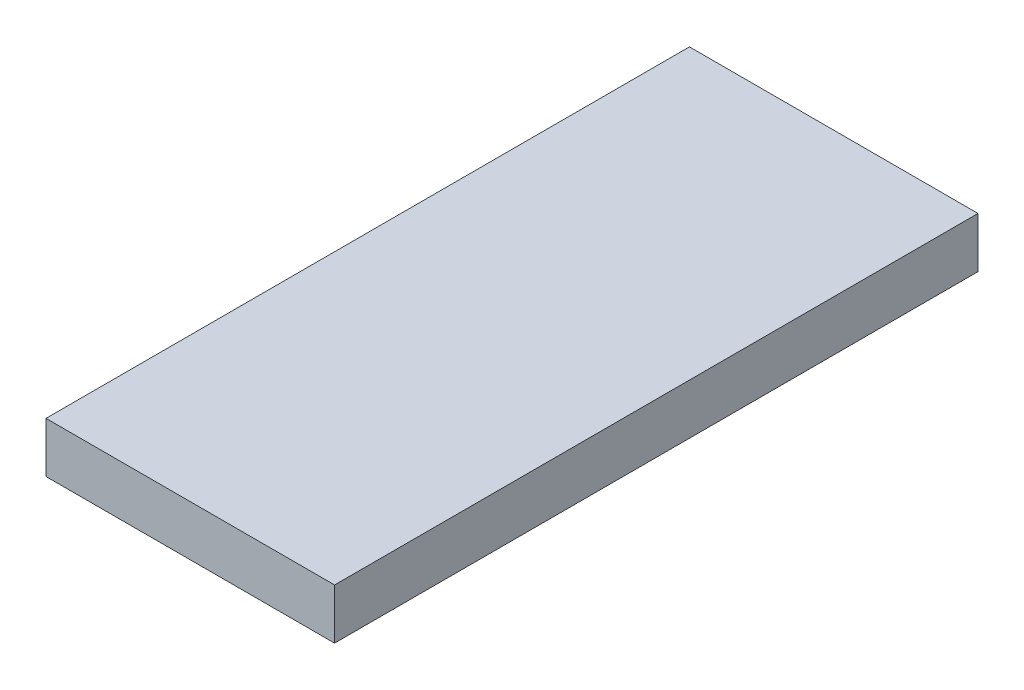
ISO-10303-21;
HEADER;
FILE_DESCRIPTION(('STEP AP214'),'2;1');
FILE_NAME('part.step','',(''),(''),'','','');
FILE_SCHEMA(('AUTOMOTIVE_DESIGN { 1 0 10303 214 1 1 1 1 }'));
ENDSEC;
DATA;
#1=APPLICATION_CONTEXT('core data for automotive mechanical design processes');
#2=APPLICATION_PROTOCOL_DEFINITION('international standard','automotive_design',2000,#1);
#3=PRODUCT_CONTEXT('',#1,'mechanical');
#4=PRODUCT('Part','Part','',(#3));
#5=PRODUCT_RELATED_PRODUCT_CATEGORY('part','',(#4));
#6=PRODUCT_DEFINITION_FORMATION('','',#4);
#7=PRODUCT_DEFINITION_CONTEXT('part definition',#1,'design');
#8=PRODUCT_DEFINITION('design','',#6,#7);
#9=PRODUCT_DEFINITION_SHAPE('','',#8);
#10=(LENGTH_UNIT() NAMED_UNIT(*) SI_UNIT(.MILLI.,.METRE.));
#11=(NAMED_UNIT(*) PLANE_ANGLE_UNIT() SI_UNIT($,.RADIAN.));
#12=(NAMED_UNIT(*) SI_UNIT($,.STERADIAN.) SOLID_ANGLE_UNIT());
#13=UNCERTAINTY_MEASURE_WITH_UNIT(LENGTH_MEASURE(1.E-05),#10,'distance_accuracy_value','');
#14=(GEOMETRIC_REPRESENTATION_CONTEXT(3) GLOBAL_UNCERTAINTY_ASSIGNED_CONTEXT((#13)) GLOBAL_UNIT_ASSIGNED_CONTEXT((#10,
#11,#12)) REPRESENTATION_CONTEXT('',''));
#15=CARTESIAN_POINT('',(0.,0.,0.));
#16=DIRECTION('',(0.,0.,1.));
#17=DIRECTION('',(1.,0.,0.));
#18=AXIS2_PLACEMENT_3D('',#15,#16,#17);
#19=CARTESIAN_POINT('',(145.41,50.8,324.25));
#20=DIRECTION('',(-1.,0.,0.));
#21=DIRECTION('',(0.,0.,1.));
#22=AXIS2_PLACEMENT_3D('',#19,#20,#21);
#23=PLANE('',#22);
#24=DIRECTION('',(0.,0.,-1.));
#25=VECTOR('',#24,1.);
#26=CARTESIAN_POINT('',(145.41,0.,324.25));
#27=LINE('',#26,#25);
#28=CARTESIAN_POINT('',(145.41,0.,324.25));
#29=VERTEX_POINT('',#28);
#30=CARTESIAN_POINT('',(145.41,0.,-324.25));
#31=VERTEX_POINT('',#30);
#32=EDGE_CURVE('E114',#29,#31,#27,.T.);
#33=ORIENTED_EDGE('',*,*,#32,.T.);
#34=DIRECTION('',(0.,-1.,0.));
#35=VECTOR('',#34,1.);
#36=CARTESIAN_POINT('',(145.41,50.8,-324.25));
#37=LINE('',#36,#35);
#38=CARTESIAN_POINT('',(145.41,50.8,-324.25));
#39=VERTEX_POINT('',#38);
#40=EDGE_CURVE('E11',#39,#31,#37,.T.);
#41=ORIENTED_EDGE('',*,*,#40,.F.);
#42=DIRECTION('',(0.,0.,-1.));
#43=VECTOR('',#42,1.);
#44=CARTESIAN_POINT('',(145.41,50.8,324.25));
#45=LINE('',#44,#43);
#46=CARTESIAN_POINT('',(145.41,50.8,324.25));
#47=VERTEX_POINT('',#46);
#48=EDGE_CURVE('E100',#47,#39,#45,.T.);
#49=ORIENTED_EDGE('',*,*,#48,.F.);
#50=DIRECTION('',(0.,-1.,0.));
#51=VECTOR('',#50,1.);
#52=CARTESIAN_POINT('',(145.41,50.8,324.25));
#53=LINE('',#52,#51);
#54=EDGE_CURVE('E108',#47,#29,#53,.T.);
#55=ORIENTED_EDGE('',*,*,#54,.T.);
#56=EDGE_LOOP('',(#33,#41,#49,#55));
#57=FACE_BOUND('',#56,.T.);
#58=ADVANCED_FACE('F44',(#57),#23,.F.);
#59=CARTESIAN_POINT('',(145.41,50.8,-324.25));
#60=DIRECTION('',(0.,0.,1.));
#61=DIRECTION('',(1.,0.,0.));
#62=AXIS2_PLACEMENT_3D('',#59,#60,#61);
#63=PLANE('',#62);
#64=DIRECTION('',(-1.,0.,0.));
#65=VECTOR('',#64,1.);
#66=CARTESIAN_POINT('',(145.41,0.,-324.25));
#67=LINE('',#66,#65);
#68=CARTESIAN_POINT('',(-145.41,0.,-324.25));
#69=VERTEX_POINT('',#68);
#70=EDGE_CURVE('E105',#31,#69,#67,.T.);
#71=ORIENTED_EDGE('',*,*,#70,.T.);
#72=DIRECTION('',(0.,-1.,0.));
#73=VECTOR('',#72,1.);
#74=CARTESIAN_POINT('',(-145.41,50.8,-324.25));
#75=LINE('',#74,#73);
#76=CARTESIAN_POINT('',(-145.41,50.8,-324.25));
#77=VERTEX_POINT('',#76);
#78=EDGE_CURVE('E53',#77,#69,#75,.T.);
#79=ORIENTED_EDGE('',*,*,#78,.F.);
#80=DIRECTION('',(-1.,0.,0.));
#81=VECTOR('',#80,1.);
#82=CARTESIAN_POINT('',(145.41,50.8,-324.25));
#83=LINE('',#82,#81);
#84=EDGE_CURVE('E95',#39,#77,#83,.T.);
#85=ORIENTED_EDGE('',*,*,#84,.F.);
#86=ORIENTED_EDGE('',*,*,#40,.T.);
#87=EDGE_LOOP('',(#71,#79,#85,#86));
#88=FACE_BOUND('',#87,.T.);
#89=ADVANCED_FACE('F101',(#88),#63,.F.);
#90=CARTESIAN_POINT('',(-145.41,50.8,324.25));
#91=DIRECTION('',(1.,0.,0.));
#92=DIRECTION('',(0.,0.,-1.));
#93=AXIS2_PLACEMENT_3D('',#90,#91,#92);
#94=PLANE('',#93);
#95=DIRECTION('',(0.,0.,1.));
#96=VECTOR('',#95,1.);
#97=CARTESIAN_POINT('',(-145.41,0.,324.25));
#98=LINE('',#97,#96);
#99=CARTESIAN_POINT('',(-145.41,0.,324.25));
#100=VERTEX_POINT('',#99);
#101=EDGE_CURVE('E79',#69,#100,#98,.T.);
#102=ORIENTED_EDGE('',*,*,#101,.T.);
#103=DIRECTION('',(0.,-1.,0.));
#104=VECTOR('',#103,1.);
#105=CARTESIAN_POINT('',(-145.41,50.8,324.25));
#106=LINE('',#105,#104);
#107=CARTESIAN_POINT('',(-145.41,50.8,324.25));
#108=VERTEX_POINT('',#107);
#109=EDGE_CURVE('E102',#108,#100,#106,.T.);
#110=ORIENTED_EDGE('',*,*,#109,.F.);
#111=DIRECTION('',(0.,0.,1.));
#112=VECTOR('',#111,1.);
#113=CARTESIAN_POINT('',(-145.41,50.8,324.25));
#114=LINE('',#113,#112);
#115=EDGE_CURVE('E92',#77,#108,#114,.T.);
#116=ORIENTED_EDGE('',*,*,#115,.F.);
#117=ORIENTED_EDGE('',*,*,#78,.T.);
#118=EDGE_LOOP('',(#102,#110,#116,#117));
#119=FACE_BOUND('',#118,.T.);
#120=ADVANCED_FACE('F104',(#119),#94,.F.);
#121=CARTESIAN_POINT('',(145.41,50.8,324.25));
#122=DIRECTION('',(0.,0.,-1.));
#123=DIRECTION('',(-1.,0.,0.));
#124=AXIS2_PLACEMENT_3D('',#121,#122,#123);
#125=PLANE('',#124);
#126=DIRECTION('',(1.,0.,0.));
#127=VECTOR('',#126,1.);
#128=CARTESIAN_POINT('',(145.41,0.,324.25));
#129=LINE('',#128,#127);
#130=EDGE_CURVE('E81',#100,#29,#129,.T.);
#131=ORIENTED_EDGE('',*,*,#130,.T.);
#132=ORIENTED_EDGE('',*,*,#54,.F.);
#133=DIRECTION('',(1.,0.,0.));
#134=VECTOR('',#133,1.);
#135=CARTESIAN_POINT('',(145.41,50.8,324.25));
#136=LINE('',#135,#134);
#137=EDGE_CURVE('E65',#108,#47,#136,.T.);
#138=ORIENTED_EDGE('',*,*,#137,.F.);
#139=ORIENTED_EDGE('',*,*,#109,.T.);
#140=EDGE_LOOP('',(#131,#132,#138,#139));
#141=FACE_BOUND('',#140,.T.);
#142=ADVANCED_FACE('F127',(#141),#125,.F.);
#143=CARTESIAN_POINT('',(0.,50.8,0.));
#144=DIRECTION('',(0.,1.,0.));
#145=DIRECTION('',(0.,0.,1.));
#146=AXIS2_PLACEMENT_3D('',#143,#144,#145);
#147=PLANE('',#146);
#148=ORIENTED_EDGE('',*,*,#48,.T.);
#149=ORIENTED_EDGE('',*,*,#84,.T.);
#150=ORIENTED_EDGE('',*,*,#115,.T.);
#151=ORIENTED_EDGE('',*,*,#137,.T.);
#152=EDGE_LOOP('',(#148,#149,#150,#151));
#153=FACE_BOUND('',#152,.T.);
#154=ADVANCED_FACE('F91',(#153),#147,.T.);
#155=CARTESIAN_POINT('',(0.,0.,0.));
#156=DIRECTION('',(0.,1.,0.));
#157=DIRECTION('',(0.,0.,1.));
#158=AXIS2_PLACEMENT_3D('',#155,#156,#157);
#159=PLANE('',#158);
#160=ORIENTED_EDGE('',*,*,#32,.F.);
#161=ORIENTED_EDGE('',*,*,#130,.F.);
#162=ORIENTED_EDGE('',*,*,#101,.F.);
#163=ORIENTED_EDGE('',*,*,#70,.F.);
#164=EDGE_LOOP('',(#160,#161,#162,#163));
#165=FACE_BOUND('',#164,.T.);
#166=ADVANCED_FACE('F129',(#165),#159,.F.);
#167=CLOSED_SHELL('',(#58,#89,#120,#142,#154,#166));
#168=MANIFOLD_SOLID_BREP('B2',#167);
#169=ADVANCED_BREP_SHAPE_REPRESENTATION('',(#18,#168),#14);
#170=SHAPE_DEFINITION_REPRESENTATION(#9,#169);
ENDSEC;
END-ISO-10303-21;
